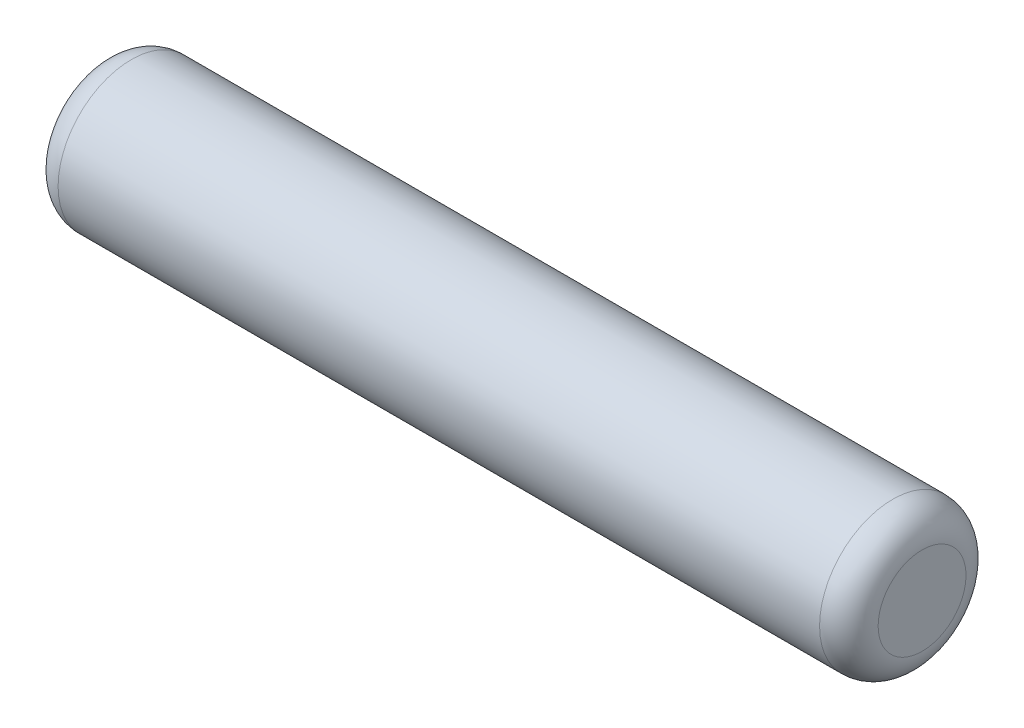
from build123d import *


with BuildPart() as part:
    # Sketch1 → Revolve1 (revolve)
    with BuildSketch(Plane.XY, mode=Mode.PRIVATE) as revolve1_sk:
        with BuildLine():
            Line((-14, 0), (14, 0))
            Line((14, 0), (14, 1.5))
            ThreePointArc((14, 1.5), (13.707106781, 2.207106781), (13, 2.5))
            Line((13, 2.5), (-13, 2.5))
            ThreePointArc((-13, 2.5), (-13.707106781, 2.207106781), (-14, 1.5))
            Line((-14, 1.5), (-14, 0))
        make_face()
    revolve(revolve1_sk.sketch.rotate(Axis((-16.329788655, 0, 0), (1, 0, 0)), 90), axis=Axis((-16.329788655, 0, 0), (1, 0, 0)))


solid = part.part
